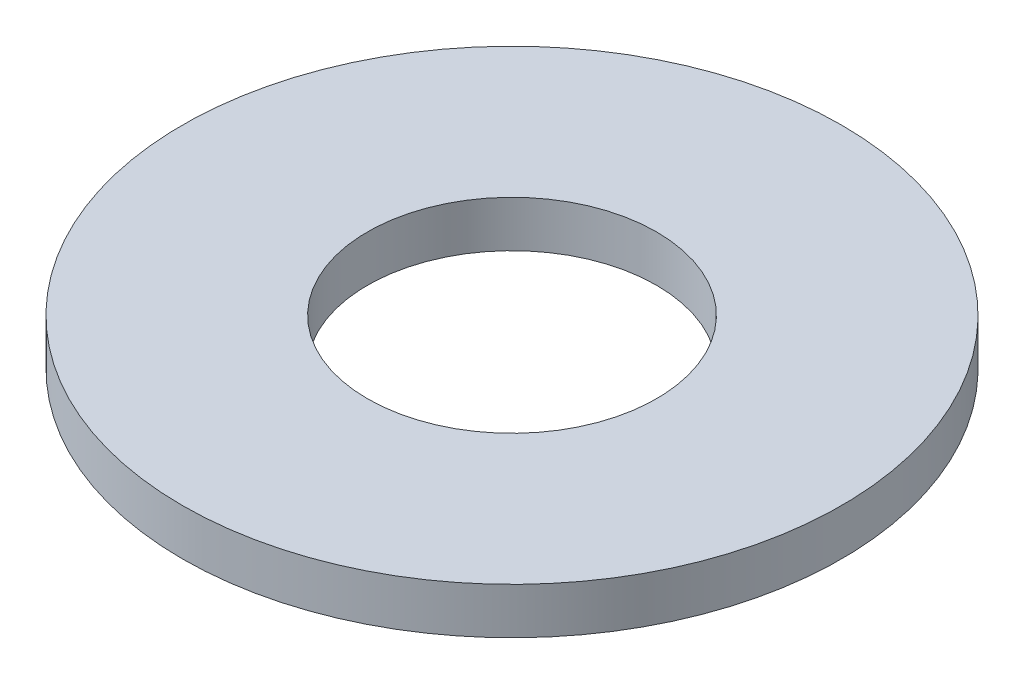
ISO-10303-21;
HEADER;
FILE_DESCRIPTION(('STEP AP214'),'2;1');
FILE_NAME('part.step','',(''),(''),'','','');
FILE_SCHEMA(('AUTOMOTIVE_DESIGN { 1 0 10303 214 1 1 1 1 }'));
ENDSEC;
DATA;
#1=APPLICATION_CONTEXT('core data for automotive mechanical design processes');
#2=APPLICATION_PROTOCOL_DEFINITION('international standard','automotive_design',2000,#1);
#3=PRODUCT_CONTEXT('',#1,'mechanical');
#4=PRODUCT('Part','Part','',(#3));
#5=PRODUCT_RELATED_PRODUCT_CATEGORY('part','',(#4));
#6=PRODUCT_DEFINITION_FORMATION('','',#4);
#7=PRODUCT_DEFINITION_CONTEXT('part definition',#1,'design');
#8=PRODUCT_DEFINITION('design','',#6,#7);
#9=PRODUCT_DEFINITION_SHAPE('','',#8);
#10=(LENGTH_UNIT() NAMED_UNIT(*) SI_UNIT(.MILLI.,.METRE.));
#11=(NAMED_UNIT(*) PLANE_ANGLE_UNIT() SI_UNIT($,.RADIAN.));
#12=(NAMED_UNIT(*) SI_UNIT($,.STERADIAN.) SOLID_ANGLE_UNIT());
#13=UNCERTAINTY_MEASURE_WITH_UNIT(LENGTH_MEASURE(1.E-05),#10,'distance_accuracy_value','');
#14=(GEOMETRIC_REPRESENTATION_CONTEXT(3) GLOBAL_UNCERTAINTY_ASSIGNED_CONTEXT((#13)) GLOBAL_UNIT_ASSIGNED_CONTEXT((#10,
#11,#12)) REPRESENTATION_CONTEXT('',''));
#15=CARTESIAN_POINT('',(0.,0.,0.));
#16=DIRECTION('',(0.,0.,1.));
#17=DIRECTION('',(1.,0.,0.));
#18=AXIS2_PLACEMENT_3D('',#15,#16,#17);
#19=CARTESIAN_POINT('',(0.,2.54,0.));
#20=DIRECTION('',(0.,1.,0.));
#21=DIRECTION('',(0.,0.,1.));
#22=AXIS2_PLACEMENT_3D('',#19,#20,#21);
#23=PLANE('',#22);
#24=CARTESIAN_POINT('',(0.,2.54,0.));
#25=DIRECTION('',(0.,1.,0.));
#26=DIRECTION('',(0.,0.,1.));
#27=AXIS2_PLACEMENT_3D('',#24,#25,#26);
#28=CIRCLE('',#27,18.0975);
#29=CARTESIAN_POINT('',(0.,2.54,18.0975));
#30=VERTEX_POINT('',#29);
#31=EDGE_CURVE('E10',#30,#30,#28,.T.);
#32=ORIENTED_EDGE('',*,*,#31,.T.);
#33=EDGE_LOOP('',(#32));
#34=FACE_BOUND('',#33,.T.);
#35=CARTESIAN_POINT('',(0.,2.54,0.));
#36=DIRECTION('',(0.,1.,0.));
#37=DIRECTION('',(0.,0.,1.));
#38=AXIS2_PLACEMENT_3D('',#35,#36,#37);
#39=CIRCLE('',#38,7.9375);
#40=CARTESIAN_POINT('',(0.,2.54,7.9375));
#41=VERTEX_POINT('',#40);
#42=EDGE_CURVE('E42',#41,#41,#39,.T.);
#43=ORIENTED_EDGE('',*,*,#42,.F.);
#44=EDGE_LOOP('',(#43));
#45=FACE_BOUND('',#44,.T.);
#46=ADVANCED_FACE('F31',(#34,#45),#23,.T.);
#47=CARTESIAN_POINT('',(0.,0.,0.));
#48=DIRECTION('',(0.,1.,0.));
#49=DIRECTION('',(0.,0.,1.));
#50=AXIS2_PLACEMENT_3D('',#47,#48,#49);
#51=PLANE('',#50);
#52=CARTESIAN_POINT('',(0.,0.,0.));
#53=DIRECTION('',(0.,1.,0.));
#54=DIRECTION('',(0.,0.,1.));
#55=AXIS2_PLACEMENT_3D('',#52,#53,#54);
#56=CIRCLE('',#55,18.0975);
#57=CARTESIAN_POINT('',(0.,0.,18.0975));
#58=VERTEX_POINT('',#57);
#59=EDGE_CURVE('E35',#58,#58,#56,.T.);
#60=ORIENTED_EDGE('',*,*,#59,.F.);
#61=EDGE_LOOP('',(#60));
#62=FACE_BOUND('',#61,.T.);
#63=CARTESIAN_POINT('',(0.,0.,0.));
#64=DIRECTION('',(0.,1.,0.));
#65=DIRECTION('',(0.,0.,1.));
#66=AXIS2_PLACEMENT_3D('',#63,#64,#65);
#67=CIRCLE('',#66,7.9375);
#68=CARTESIAN_POINT('',(0.,0.,7.9375));
#69=VERTEX_POINT('',#68);
#70=EDGE_CURVE('E44',#69,#69,#67,.T.);
#71=ORIENTED_EDGE('',*,*,#70,.T.);
#72=EDGE_LOOP('',(#71));
#73=FACE_BOUND('',#72,.T.);
#74=ADVANCED_FACE('F54',(#62,#73),#51,.F.);
#75=CARTESIAN_POINT('',(0.,2.54,0.));
#76=DIRECTION('',(0.,-1.,0.));
#77=DIRECTION('',(0.,0.,-1.));
#78=AXIS2_PLACEMENT_3D('',#75,#76,#77);
#79=CYLINDRICAL_SURFACE('',#78,18.0975);
#80=ORIENTED_EDGE('',*,*,#31,.F.);
#81=EDGE_LOOP('',(#80));
#82=FACE_BOUND('',#81,.T.);
#83=ORIENTED_EDGE('',*,*,#59,.T.);
#84=EDGE_LOOP('',(#83));
#85=FACE_BOUND('',#84,.T.);
#86=ADVANCED_FACE('F33',(#82,#85),#79,.T.);
#87=CARTESIAN_POINT('',(0.,2.54,0.));
#88=DIRECTION('',(0.,-1.,0.));
#89=DIRECTION('',(0.,0.,-1.));
#90=AXIS2_PLACEMENT_3D('',#87,#88,#89);
#91=CYLINDRICAL_SURFACE('',#90,7.9375);
#92=ORIENTED_EDGE('',*,*,#42,.T.);
#93=EDGE_LOOP('',(#92));
#94=FACE_BOUND('',#93,.T.);
#95=ORIENTED_EDGE('',*,*,#70,.F.);
#96=EDGE_LOOP('',(#95));
#97=FACE_BOUND('',#96,.T.);
#98=ADVANCED_FACE('F50',(#94,#97),#91,.F.);
#99=CLOSED_SHELL('',(#46,#74,#86,#98));
#100=MANIFOLD_SOLID_BREP('B2',#99);
#101=ADVANCED_BREP_SHAPE_REPRESENTATION('',(#18,#100),#14);
#102=SHAPE_DEFINITION_REPRESENTATION(#9,#101);
ENDSEC;
END-ISO-10303-21;
